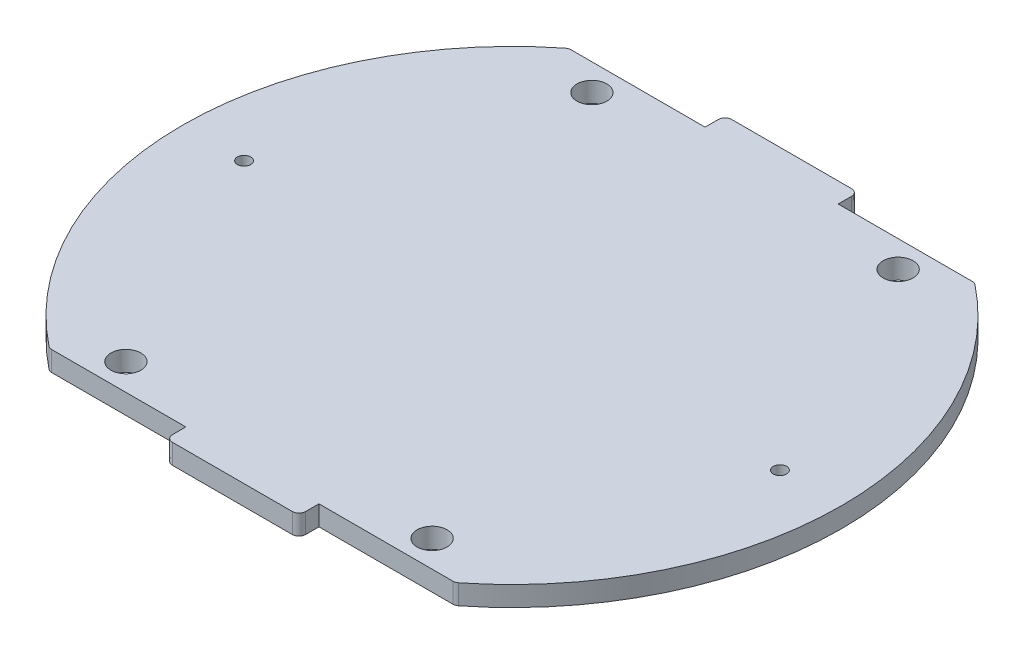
ISO-10303-21;
HEADER;
FILE_DESCRIPTION(('STEP AP214'),'2;1');
FILE_NAME('part.step','',(''),(''),'','','');
FILE_SCHEMA(('AUTOMOTIVE_DESIGN { 1 0 10303 214 1 1 1 1 }'));
ENDSEC;
DATA;
#1=APPLICATION_CONTEXT('core data for automotive mechanical design processes');
#2=APPLICATION_PROTOCOL_DEFINITION('international standard','automotive_design',2000,#1);
#3=PRODUCT_CONTEXT('',#1,'mechanical');
#4=PRODUCT('Part','Part','',(#3));
#5=PRODUCT_RELATED_PRODUCT_CATEGORY('part','',(#4));
#6=PRODUCT_DEFINITION_FORMATION('','',#4);
#7=PRODUCT_DEFINITION_CONTEXT('part definition',#1,'design');
#8=PRODUCT_DEFINITION('design','',#6,#7);
#9=PRODUCT_DEFINITION_SHAPE('','',#8);
#10=(LENGTH_UNIT() NAMED_UNIT(*) SI_UNIT(.MILLI.,.METRE.));
#11=(NAMED_UNIT(*) PLANE_ANGLE_UNIT() SI_UNIT($,.RADIAN.));
#12=(NAMED_UNIT(*) SI_UNIT($,.STERADIAN.) SOLID_ANGLE_UNIT());
#13=UNCERTAINTY_MEASURE_WITH_UNIT(LENGTH_MEASURE(1.E-05),#10,'distance_accuracy_value','');
#14=(GEOMETRIC_REPRESENTATION_CONTEXT(3) GLOBAL_UNCERTAINTY_ASSIGNED_CONTEXT((#13)) GLOBAL_UNIT_ASSIGNED_CONTEXT((#10,
#11,#12)) REPRESENTATION_CONTEXT('',''));
#15=CARTESIAN_POINT('',(0.,0.,0.));
#16=DIRECTION('',(0.,0.,1.));
#17=DIRECTION('',(1.,0.,0.));
#18=AXIS2_PLACEMENT_3D('',#15,#16,#17);
#19=CARTESIAN_POINT('',(0.,0.,0.));
#20=DIRECTION('',(0.,1.,0.));
#21=DIRECTION('',(0.,0.,1.));
#22=AXIS2_PLACEMENT_3D('',#19,#20,#21);
#23=PLANE('',#22);
#24=DIRECTION('',(0.,0.,-1.));
#25=VECTOR('',#24,1.);
#26=CARTESIAN_POINT('',(-7.5,0.,28.5));
#27=LINE('',#26,#25);
#28=CARTESIAN_POINT('',(-7.5,0.,31.5));
#29=VERTEX_POINT('',#28);
#30=CARTESIAN_POINT('',(-7.5,0.,25.5));
#31=VERTEX_POINT('',#30);
#32=EDGE_CURVE('E251',#29,#31,#27,.T.);
#33=ORIENTED_EDGE('',*,*,#32,.F.);
#34=DIRECTION('',(1.,0.,0.));
#35=VECTOR('',#34,1.);
#36=CARTESIAN_POINT('',(7.5,0.,31.5));
#37=LINE('',#36,#35);
#38=CARTESIAN_POINT('',(7.49999999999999,0.,31.5));
#39=VERTEX_POINT('',#38);
#40=EDGE_CURVE('E427',#29,#39,#37,.T.);
#41=ORIENTED_EDGE('',*,*,#40,.T.);
#42=DIRECTION('',(0.,0.,1.));
#43=VECTOR('',#42,1.);
#44=CARTESIAN_POINT('',(7.5,0.,28.5));
#45=LINE('',#44,#43);
#46=CARTESIAN_POINT('',(7.50000000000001,0.,25.5));
#47=VERTEX_POINT('',#46);
#48=EDGE_CURVE('E256',#47,#39,#45,.T.);
#49=ORIENTED_EDGE('',*,*,#48,.F.);
#50=DIRECTION('',(1.,0.,0.));
#51=VECTOR('',#50,1.);
#52=CARTESIAN_POINT('',(-7.5,0.,25.5));
#53=LINE('',#52,#51);
#54=EDGE_CURVE('E267',#31,#47,#53,.T.);
#55=ORIENTED_EDGE('',*,*,#54,.F.);
#56=EDGE_LOOP('',(#33,#41,#49,#55));
#57=FACE_BOUND('',#56,.T.);
#58=CARTESIAN_POINT('',(-40.25,0.,0.));
#59=DIRECTION('',(0.,1.,0.));
#60=DIRECTION('',(0.,0.,1.));
#61=AXIS2_PLACEMENT_3D('',#58,#59,#60);
#62=CIRCLE('',#61,0.999999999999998);
#63=CARTESIAN_POINT('',(-40.25,0.,1.));
#64=VERTEX_POINT('',#63);
#65=EDGE_CURVE('E820',#64,#64,#62,.T.);
#66=ORIENTED_EDGE('',*,*,#65,.T.);
#67=EDGE_LOOP('',(#66));
#68=FACE_BOUND('',#67,.T.);
#69=CARTESIAN_POINT('',(40.25,0.,0.));
#70=DIRECTION('',(0.,1.,0.));
#71=DIRECTION('',(0.,0.,-1.));
#72=AXIS2_PLACEMENT_3D('',#69,#70,#71);
#73=CIRCLE('',#72,0.999999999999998);
#74=CARTESIAN_POINT('',(40.25,0.,-0.999999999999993));
#75=VERTEX_POINT('',#74);
#76=EDGE_CURVE('E825',#75,#75,#73,.T.);
#77=ORIENTED_EDGE('',*,*,#76,.T.);
#78=EDGE_LOOP('',(#77));
#79=FACE_BOUND('',#78,.T.);
#80=CARTESIAN_POINT('',(-23.,0.,35.));
#81=DIRECTION('',(0.,1.,0.));
#82=DIRECTION('',(0.,0.,1.));
#83=AXIS2_PLACEMENT_3D('',#80,#81,#82);
#84=CIRCLE('',#83,2.2479);
#85=CARTESIAN_POINT('',(-23.,0.,37.2479));
#86=VERTEX_POINT('',#85);
#87=EDGE_CURVE('E829',#86,#86,#84,.T.);
#88=ORIENTED_EDGE('',*,*,#87,.T.);
#89=EDGE_LOOP('',(#88));
#90=FACE_BOUND('',#89,.T.);
#91=CARTESIAN_POINT('',(23.,0.,35.));
#92=DIRECTION('',(0.,1.,0.));
#93=DIRECTION('',(0.,0.,1.));
#94=AXIS2_PLACEMENT_3D('',#91,#92,#93);
#95=CIRCLE('',#94,2.2479);
#96=CARTESIAN_POINT('',(23.,0.,37.2479));
#97=VERTEX_POINT('',#96);
#98=EDGE_CURVE('E833',#97,#97,#95,.T.);
#99=ORIENTED_EDGE('',*,*,#98,.T.);
#100=EDGE_LOOP('',(#99));
#101=FACE_BOUND('',#100,.T.);
#102=CARTESIAN_POINT('',(23.,0.,-35.));
#103=DIRECTION('',(0.,1.,0.));
#104=DIRECTION('',(0.,0.,1.));
#105=AXIS2_PLACEMENT_3D('',#102,#103,#104);
#106=CIRCLE('',#105,2.2479);
#107=CARTESIAN_POINT('',(23.,0.,-32.7521));
#108=VERTEX_POINT('',#107);
#109=EDGE_CURVE('E837',#108,#108,#106,.T.);
#110=ORIENTED_EDGE('',*,*,#109,.T.);
#111=EDGE_LOOP('',(#110));
#112=FACE_BOUND('',#111,.T.);
#113=CARTESIAN_POINT('',(-23.,0.,-35.));
#114=DIRECTION('',(0.,1.,0.));
#115=DIRECTION('',(0.,0.,1.));
#116=AXIS2_PLACEMENT_3D('',#113,#114,#115);
#117=CIRCLE('',#116,2.2479);
#118=CARTESIAN_POINT('',(-23.,0.,-32.7521));
#119=VERTEX_POINT('',#118);
#120=EDGE_CURVE('E841',#119,#119,#117,.T.);
#121=ORIENTED_EDGE('',*,*,#120,.T.);
#122=EDGE_LOOP('',(#121));
#123=FACE_BOUND('',#122,.T.);
#124=DIRECTION('',(1.,0.,0.));
#125=VECTOR('',#124,1.);
#126=CARTESIAN_POINT('',(-30.4836021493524,0.,-39.));
#127=LINE('',#126,#125);
#128=CARTESIAN_POINT('',(10.,0.,-39.));
#129=VERTEX_POINT('',#128);
#130=CARTESIAN_POINT('',(30.1371863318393,0.,-39.));
#131=VERTEX_POINT('',#130);
#132=EDGE_CURVE('E327',#129,#131,#127,.T.);
#133=ORIENTED_EDGE('',*,*,#132,.T.);
#134=CARTESIAN_POINT('',(30.1371863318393,0.,-38.));
#135=DIRECTION('',(0.,1.,0.));
#136=DIRECTION('',(0.,0.,1.));
#137=AXIS2_PLACEMENT_3D('',#134,#135,#136);
#138=CIRCLE('',#137,1.);
#139=CARTESIAN_POINT('',(30.7585716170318,0.,-38.7835051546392));
#140=VERTEX_POINT('',#139);
#141=EDGE_CURVE('E365',#131,#140,#138,.F.);
#142=ORIENTED_EDGE('',*,*,#141,.T.);
#143=CARTESIAN_POINT('',(0.,0.,0.));
#144=DIRECTION('',(0.,-1.,0.));
#145=DIRECTION('',(0.,0.,-1.));
#146=AXIS2_PLACEMENT_3D('',#143,#144,#145);
#147=CIRCLE('',#146,49.5);
#148=CARTESIAN_POINT('',(30.7585716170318,0.,38.7835051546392));
#149=VERTEX_POINT('',#148);
#150=EDGE_CURVE('E320',#140,#149,#147,.T.);
#151=ORIENTED_EDGE('',*,*,#150,.T.);
#152=CARTESIAN_POINT('',(30.1371863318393,0.,38.));
#153=DIRECTION('',(0.,1.,0.));
#154=DIRECTION('',(0.,0.,1.));
#155=AXIS2_PLACEMENT_3D('',#152,#153,#154);
#156=CIRCLE('',#155,1.);
#157=CARTESIAN_POINT('',(30.1371863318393,0.,39.));
#158=VERTEX_POINT('',#157);
#159=EDGE_CURVE('E357',#149,#158,#156,.F.);
#160=ORIENTED_EDGE('',*,*,#159,.T.);
#161=DIRECTION('',(-1.,0.,0.));
#162=VECTOR('',#161,1.);
#163=CARTESIAN_POINT('',(30.4836021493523,0.,39.));
#164=LINE('',#163,#162);
#165=CARTESIAN_POINT('',(10.,0.,39.));
#166=VERTEX_POINT('',#165);
#167=EDGE_CURVE('E847',#158,#166,#164,.T.);
#168=ORIENTED_EDGE('',*,*,#167,.T.);
#169=DIRECTION('',(0.,0.,1.));
#170=VECTOR('',#169,1.);
#171=CARTESIAN_POINT('',(10.,0.,39.));
#172=LINE('',#171,#170);
#173=CARTESIAN_POINT('',(10.,0.,41.));
#174=VERTEX_POINT('',#173);
#175=EDGE_CURVE('E855',#166,#174,#172,.T.);
#176=ORIENTED_EDGE('',*,*,#175,.T.);
#177=CARTESIAN_POINT('',(9.,0.,41.));
#178=DIRECTION('',(0.,1.,0.));
#179=DIRECTION('',(0.,0.,1.));
#180=AXIS2_PLACEMENT_3D('',#177,#178,#179);
#181=CIRCLE('',#180,1.);
#182=CARTESIAN_POINT('',(9.,0.,42.));
#183=VERTEX_POINT('',#182);
#184=EDGE_CURVE('E352',#174,#183,#181,.F.);
#185=ORIENTED_EDGE('',*,*,#184,.T.);
#186=DIRECTION('',(-1.,0.,0.));
#187=VECTOR('',#186,1.);
#188=CARTESIAN_POINT('',(-10.,0.,42.));
#189=LINE('',#188,#187);
#190=CARTESIAN_POINT('',(-9.,0.,42.));
#191=VERTEX_POINT('',#190);
#192=EDGE_CURVE('E895',#183,#191,#189,.T.);
#193=ORIENTED_EDGE('',*,*,#192,.T.);
#194=CARTESIAN_POINT('',(-9.,0.,41.));
#195=DIRECTION('',(0.,1.,0.));
#196=DIRECTION('',(0.,0.,1.));
#197=AXIS2_PLACEMENT_3D('',#194,#195,#196);
#198=CIRCLE('',#197,1.);
#199=CARTESIAN_POINT('',(-10.,0.,41.));
#200=VERTEX_POINT('',#199);
#201=EDGE_CURVE('E350',#191,#200,#198,.F.);
#202=ORIENTED_EDGE('',*,*,#201,.T.);
#203=DIRECTION('',(0.,0.,-1.));
#204=VECTOR('',#203,1.);
#205=CARTESIAN_POINT('',(-10.,0.,39.));
#206=LINE('',#205,#204);
#207=CARTESIAN_POINT('',(-10.,0.,39.));
#208=VERTEX_POINT('',#207);
#209=EDGE_CURVE('E335',#200,#208,#206,.T.);
#210=ORIENTED_EDGE('',*,*,#209,.T.);
#211=CARTESIAN_POINT('',(-30.1371863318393,0.,39.));
#212=VERTEX_POINT('',#211);
#213=EDGE_CURVE('E844',#208,#212,#164,.T.);
#214=ORIENTED_EDGE('',*,*,#213,.T.);
#215=CARTESIAN_POINT('',(-30.1371863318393,0.,38.));
#216=DIRECTION('',(0.,1.,0.));
#217=DIRECTION('',(0.,0.,1.));
#218=AXIS2_PLACEMENT_3D('',#215,#216,#217);
#219=CIRCLE('',#218,1.);
#220=CARTESIAN_POINT('',(-30.7585716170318,0.,38.7835051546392));
#221=VERTEX_POINT('',#220);
#222=EDGE_CURVE('E355',#212,#221,#219,.F.);
#223=ORIENTED_EDGE('',*,*,#222,.T.);
#224=CARTESIAN_POINT('',(0.,0.,0.));
#225=DIRECTION('',(0.,-1.,0.));
#226=DIRECTION('',(0.,0.,-1.));
#227=AXIS2_PLACEMENT_3D('',#224,#225,#226);
#228=CIRCLE('',#227,49.5);
#229=CARTESIAN_POINT('',(-30.7585716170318,0.,-38.7835051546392));
#230=VERTEX_POINT('',#229);
#231=EDGE_CURVE('E852',#221,#230,#228,.T.);
#232=ORIENTED_EDGE('',*,*,#231,.T.);
#233=CARTESIAN_POINT('',(-30.1371863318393,0.,-38.));
#234=DIRECTION('',(0.,1.,0.));
#235=DIRECTION('',(0.,0.,1.));
#236=AXIS2_PLACEMENT_3D('',#233,#234,#235);
#237=CIRCLE('',#236,1.);
#238=CARTESIAN_POINT('',(-30.1371863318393,0.,-39.));
#239=VERTEX_POINT('',#238);
#240=EDGE_CURVE('E363',#230,#239,#237,.F.);
#241=ORIENTED_EDGE('',*,*,#240,.T.);
#242=CARTESIAN_POINT('',(-10.,0.,-39.));
#243=VERTEX_POINT('',#242);
#244=EDGE_CURVE('E348',#239,#243,#127,.T.);
#245=ORIENTED_EDGE('',*,*,#244,.T.);
#246=DIRECTION('',(0.,0.,-1.));
#247=VECTOR('',#246,1.);
#248=CARTESIAN_POINT('',(-10.,0.,-39.));
#249=LINE('',#248,#247);
#250=CARTESIAN_POINT('',(-10.,0.,-41.));
#251=VERTEX_POINT('',#250);
#252=EDGE_CURVE('E276',#243,#251,#249,.T.);
#253=ORIENTED_EDGE('',*,*,#252,.T.);
#254=CARTESIAN_POINT('',(-9.,0.,-41.));
#255=DIRECTION('',(0.,1.,0.));
#256=DIRECTION('',(0.,0.,1.));
#257=AXIS2_PLACEMENT_3D('',#254,#255,#256);
#258=CIRCLE('',#257,1.);
#259=CARTESIAN_POINT('',(-9.,0.,-42.));
#260=VERTEX_POINT('',#259);
#261=EDGE_CURVE('E359',#251,#260,#258,.F.);
#262=ORIENTED_EDGE('',*,*,#261,.T.);
#263=DIRECTION('',(1.,0.,0.));
#264=VECTOR('',#263,1.);
#265=CARTESIAN_POINT('',(-10.,0.,-42.));
#266=LINE('',#265,#264);
#267=CARTESIAN_POINT('',(9.,0.,-42.));
#268=VERTEX_POINT('',#267);
#269=EDGE_CURVE('E277',#260,#268,#266,.T.);
#270=ORIENTED_EDGE('',*,*,#269,.T.);
#271=CARTESIAN_POINT('',(9.,0.,-41.));
#272=DIRECTION('',(0.,1.,0.));
#273=DIRECTION('',(0.,0.,1.));
#274=AXIS2_PLACEMENT_3D('',#271,#272,#273);
#275=CIRCLE('',#274,1.);
#276=CARTESIAN_POINT('',(10.,0.,-41.));
#277=VERTEX_POINT('',#276);
#278=EDGE_CURVE('E361',#268,#277,#275,.F.);
#279=ORIENTED_EDGE('',*,*,#278,.T.);
#280=DIRECTION('',(0.,0.,1.));
#281=VECTOR('',#280,1.);
#282=CARTESIAN_POINT('',(10.,0.,-39.));
#283=LINE('',#282,#281);
#284=EDGE_CURVE('E280',#277,#129,#283,.T.);
#285=ORIENTED_EDGE('',*,*,#284,.T.);
#286=EDGE_LOOP('',(#133,#142,#151,#160,#168,#176,#185,#193,#202,#210,#214,#223,#232,#241,#245,
#253,#262,#270,#279,#285));
#287=FACE_BOUND('',#286,.T.);
#288=DIRECTION('',(0.,0.,1.));
#289=VECTOR('',#288,1.);
#290=CARTESIAN_POINT('',(7.5,0.,-28.5));
#291=LINE('',#290,#289);
#292=CARTESIAN_POINT('',(7.49999999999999,0.,-31.5));
#293=VERTEX_POINT('',#292);
#294=CARTESIAN_POINT('',(7.50000000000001,0.,-25.5));
#295=VERTEX_POINT('',#294);
#296=EDGE_CURVE('E47',#293,#295,#291,.T.);
#297=ORIENTED_EDGE('',*,*,#296,.F.);
#298=DIRECTION('',(-1.,0.,0.));
#299=VECTOR('',#298,1.);
#300=CARTESIAN_POINT('',(-7.5,0.,-31.5));
#301=LINE('',#300,#299);
#302=CARTESIAN_POINT('',(-7.5,0.,-31.5));
#303=VERTEX_POINT('',#302);
#304=EDGE_CURVE('E222',#293,#303,#301,.T.);
#305=ORIENTED_EDGE('',*,*,#304,.T.);
#306=DIRECTION('',(0.,0.,-1.));
#307=VECTOR('',#306,1.);
#308=CARTESIAN_POINT('',(-7.5,0.,-28.5));
#309=LINE('',#308,#307);
#310=CARTESIAN_POINT('',(-7.5,0.,-25.5));
#311=VERTEX_POINT('',#310);
#312=EDGE_CURVE('E55',#311,#303,#309,.T.);
#313=ORIENTED_EDGE('',*,*,#312,.F.);
#314=DIRECTION('',(-1.,0.,0.));
#315=VECTOR('',#314,1.);
#316=CARTESIAN_POINT('',(-7.5,0.,-25.5));
#317=LINE('',#316,#315);
#318=EDGE_CURVE('E240',#295,#311,#317,.T.);
#319=ORIENTED_EDGE('',*,*,#318,.F.);
#320=EDGE_LOOP('',(#297,#305,#313,#319));
#321=FACE_BOUND('',#320,.T.);
#322=ADVANCED_FACE('F32',(#57,#68,#79,#90,#101,#112,#123,#287,#321),#23,.F.);
#323=CARTESIAN_POINT('',(-30.4836021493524,3.,-39.));
#324=DIRECTION('',(0.,0.,-1.));
#325=DIRECTION('',(-1.,0.,0.));
#326=AXIS2_PLACEMENT_3D('',#323,#324,#325);
#327=PLANE('',#326);
#328=ORIENTED_EDGE('',*,*,#244,.F.);
#329=DIRECTION('',(0.,-1.,0.));
#330=VECTOR('',#329,1.);
#331=CARTESIAN_POINT('',(-30.1371863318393,3.,-39.));
#332=LINE('',#331,#330);
#333=CARTESIAN_POINT('',(-30.1371863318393,3.,-39.));
#334=VERTEX_POINT('',#333);
#335=EDGE_CURVE('E401',#239,#334,#332,.F.);
#336=ORIENTED_EDGE('',*,*,#335,.T.);
#337=DIRECTION('',(1.,0.,0.));
#338=VECTOR('',#337,1.);
#339=CARTESIAN_POINT('',(-30.4836021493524,3.,-39.));
#340=LINE('',#339,#338);
#341=CARTESIAN_POINT('',(-10.,3.,-39.));
#342=VERTEX_POINT('',#341);
#343=EDGE_CURVE('E308',#334,#342,#340,.T.);
#344=ORIENTED_EDGE('',*,*,#343,.T.);
#345=DIRECTION('',(0.,-1.,0.));
#346=VECTOR('',#345,1.);
#347=CARTESIAN_POINT('',(-10.,23.2237484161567,-39.));
#348=LINE('',#347,#346);
#349=EDGE_CURVE('E295',#342,#243,#348,.T.);
#350=ORIENTED_EDGE('',*,*,#349,.T.);
#351=EDGE_LOOP('',(#328,#336,#344,#350));
#352=FACE_BOUND('',#351,.T.);
#353=ADVANCED_FACE('F459',(#352),#327,.T.);
#354=CARTESIAN_POINT('',(30.4836021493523,3.,39.));
#355=DIRECTION('',(0.,0.,1.));
#356=DIRECTION('',(1.,0.,0.));
#357=AXIS2_PLACEMENT_3D('',#354,#355,#356);
#358=PLANE('',#357);
#359=ORIENTED_EDGE('',*,*,#167,.F.);
#360=DIRECTION('',(0.,-1.,0.));
#361=VECTOR('',#360,1.);
#362=CARTESIAN_POINT('',(30.1371863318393,3.,39.));
#363=LINE('',#362,#361);
#364=CARTESIAN_POINT('',(30.1371863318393,3.,39.));
#365=VERTEX_POINT('',#364);
#366=EDGE_CURVE('E412',#158,#365,#363,.F.);
#367=ORIENTED_EDGE('',*,*,#366,.T.);
#368=DIRECTION('',(-1.,0.,0.));
#369=VECTOR('',#368,1.);
#370=CARTESIAN_POINT('',(30.4836021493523,3.,39.));
#371=LINE('',#370,#369);
#372=CARTESIAN_POINT('',(10.,3.,39.));
#373=VERTEX_POINT('',#372);
#374=EDGE_CURVE('E305',#365,#373,#371,.T.);
#375=ORIENTED_EDGE('',*,*,#374,.T.);
#376=DIRECTION('',(0.,-1.,0.));
#377=VECTOR('',#376,1.);
#378=CARTESIAN_POINT('',(10.,23.2237484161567,39.));
#379=LINE('',#378,#377);
#380=EDGE_CURVE('E893',#373,#166,#379,.T.);
#381=ORIENTED_EDGE('',*,*,#380,.T.);
#382=EDGE_LOOP('',(#359,#367,#375,#381));
#383=FACE_BOUND('',#382,.T.);
#384=ADVANCED_FACE('F464',(#383),#358,.T.);
#385=CARTESIAN_POINT('',(0.,3.,0.));
#386=DIRECTION('',(0.,1.,0.));
#387=DIRECTION('',(0.,0.,1.));
#388=AXIS2_PLACEMENT_3D('',#385,#386,#387);
#389=PLANE('',#388);
#390=CARTESIAN_POINT('',(-40.25,3.,0.));
#391=DIRECTION('',(0.,1.,0.));
#392=DIRECTION('',(0.,0.,1.));
#393=AXIS2_PLACEMENT_3D('',#390,#391,#392);
#394=CIRCLE('',#393,0.999999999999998);
#395=CARTESIAN_POINT('',(-40.25,3.,1.));
#396=VERTEX_POINT('',#395);
#397=EDGE_CURVE('E817',#396,#396,#394,.T.);
#398=ORIENTED_EDGE('',*,*,#397,.F.);
#399=EDGE_LOOP('',(#398));
#400=FACE_BOUND('',#399,.T.);
#401=CARTESIAN_POINT('',(40.25,3.,0.));
#402=DIRECTION('',(0.,1.,0.));
#403=DIRECTION('',(0.,0.,-1.));
#404=AXIS2_PLACEMENT_3D('',#401,#402,#403);
#405=CIRCLE('',#404,0.999999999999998);
#406=CARTESIAN_POINT('',(40.25,3.,-0.999999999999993));
#407=VERTEX_POINT('',#406);
#408=EDGE_CURVE('E821',#407,#407,#405,.T.);
#409=ORIENTED_EDGE('',*,*,#408,.F.);
#410=EDGE_LOOP('',(#409));
#411=FACE_BOUND('',#410,.T.);
#412=CARTESIAN_POINT('',(-23.,3.,35.));
#413=DIRECTION('',(0.,1.,0.));
#414=DIRECTION('',(0.,0.,1.));
#415=AXIS2_PLACEMENT_3D('',#412,#413,#414);
#416=CIRCLE('',#415,2.2479);
#417=CARTESIAN_POINT('',(-23.,3.,37.2479));
#418=VERTEX_POINT('',#417);
#419=EDGE_CURVE('E832',#418,#418,#416,.T.);
#420=ORIENTED_EDGE('',*,*,#419,.F.);
#421=EDGE_LOOP('',(#420));
#422=FACE_BOUND('',#421,.T.);
#423=CARTESIAN_POINT('',(23.,3.,35.));
#424=DIRECTION('',(0.,1.,0.));
#425=DIRECTION('',(0.,0.,1.));
#426=AXIS2_PLACEMENT_3D('',#423,#424,#425);
#427=CIRCLE('',#426,2.2479);
#428=CARTESIAN_POINT('',(23.,3.,37.2479));
#429=VERTEX_POINT('',#428);
#430=EDGE_CURVE('E836',#429,#429,#427,.T.);
#431=ORIENTED_EDGE('',*,*,#430,.F.);
#432=EDGE_LOOP('',(#431));
#433=FACE_BOUND('',#432,.T.);
#434=CARTESIAN_POINT('',(23.,3.,-35.));
#435=DIRECTION('',(0.,1.,0.));
#436=DIRECTION('',(0.,0.,1.));
#437=AXIS2_PLACEMENT_3D('',#434,#435,#436);
#438=CIRCLE('',#437,2.2479);
#439=CARTESIAN_POINT('',(23.,3.,-32.7521));
#440=VERTEX_POINT('',#439);
#441=EDGE_CURVE('E840',#440,#440,#438,.T.);
#442=ORIENTED_EDGE('',*,*,#441,.F.);
#443=EDGE_LOOP('',(#442));
#444=FACE_BOUND('',#443,.T.);
#445=CARTESIAN_POINT('',(-23.,3.,-35.));
#446=DIRECTION('',(0.,1.,0.));
#447=DIRECTION('',(0.,0.,1.));
#448=AXIS2_PLACEMENT_3D('',#445,#446,#447);
#449=CIRCLE('',#448,2.2479);
#450=CARTESIAN_POINT('',(-23.,3.,-32.7521));
#451=VERTEX_POINT('',#450);
#452=EDGE_CURVE('E311',#451,#451,#449,.T.);
#453=ORIENTED_EDGE('',*,*,#452,.F.);
#454=EDGE_LOOP('',(#453));
#455=FACE_BOUND('',#454,.T.);
#456=CARTESIAN_POINT('',(0.,3.,0.));
#457=DIRECTION('',(0.,-1.,0.));
#458=DIRECTION('',(0.,0.,-1.));
#459=AXIS2_PLACEMENT_3D('',#456,#457,#458);
#460=CIRCLE('',#459,49.5);
#461=CARTESIAN_POINT('',(30.7585716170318,3.,-38.7835051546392));
#462=VERTEX_POINT('',#461);
#463=CARTESIAN_POINT('',(30.7585716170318,3.,38.7835051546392));
#464=VERTEX_POINT('',#463);
#465=EDGE_CURVE('E868',#462,#464,#460,.T.);
#466=ORIENTED_EDGE('',*,*,#465,.F.);
#467=CARTESIAN_POINT('',(30.1371863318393,3.,-38.));
#468=DIRECTION('',(0.,1.,0.));
#469=DIRECTION('',(0.,0.,1.));
#470=AXIS2_PLACEMENT_3D('',#467,#468,#469);
#471=CIRCLE('',#470,1.);
#472=CARTESIAN_POINT('',(30.1371863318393,3.,-39.));
#473=VERTEX_POINT('',#472);
#474=EDGE_CURVE('E394',#462,#473,#471,.T.);
#475=ORIENTED_EDGE('',*,*,#474,.T.);
#476=CARTESIAN_POINT('',(10.,3.,-39.));
#477=VERTEX_POINT('',#476);
#478=EDGE_CURVE('E312',#477,#473,#340,.T.);
#479=ORIENTED_EDGE('',*,*,#478,.F.);
#480=DIRECTION('',(0.,0.,1.));
#481=VECTOR('',#480,1.);
#482=CARTESIAN_POINT('',(10.,3.,-39.));
#483=LINE('',#482,#481);
#484=CARTESIAN_POINT('',(10.,3.,-41.));
#485=VERTEX_POINT('',#484);
#486=EDGE_CURVE('E284',#485,#477,#483,.T.);
#487=ORIENTED_EDGE('',*,*,#486,.F.);
#488=CARTESIAN_POINT('',(9.,3.,-41.));
#489=DIRECTION('',(0.,1.,0.));
#490=DIRECTION('',(0.,0.,1.));
#491=AXIS2_PLACEMENT_3D('',#488,#489,#490);
#492=CIRCLE('',#491,1.);
#493=CARTESIAN_POINT('',(9.,3.,-42.));
#494=VERTEX_POINT('',#493);
#495=EDGE_CURVE('E390',#485,#494,#492,.T.);
#496=ORIENTED_EDGE('',*,*,#495,.T.);
#497=DIRECTION('',(1.,0.,0.));
#498=VECTOR('',#497,1.);
#499=CARTESIAN_POINT('',(-10.,3.,-42.));
#500=LINE('',#499,#498);
#501=CARTESIAN_POINT('',(-9.,3.,-42.));
#502=VERTEX_POINT('',#501);
#503=EDGE_CURVE('E281',#502,#494,#500,.T.);
#504=ORIENTED_EDGE('',*,*,#503,.F.);
#505=CARTESIAN_POINT('',(-9.,3.,-41.));
#506=DIRECTION('',(0.,1.,0.));
#507=DIRECTION('',(0.,0.,1.));
#508=AXIS2_PLACEMENT_3D('',#505,#506,#507);
#509=CIRCLE('',#508,1.);
#510=CARTESIAN_POINT('',(-10.,3.,-41.));
#511=VERTEX_POINT('',#510);
#512=EDGE_CURVE('E388',#502,#511,#509,.T.);
#513=ORIENTED_EDGE('',*,*,#512,.T.);
#514=DIRECTION('',(0.,0.,-1.));
#515=VECTOR('',#514,1.);
#516=CARTESIAN_POINT('',(-10.,3.,-39.));
#517=LINE('',#516,#515);
#518=EDGE_CURVE('E285',#342,#511,#517,.T.);
#519=ORIENTED_EDGE('',*,*,#518,.F.);
#520=ORIENTED_EDGE('',*,*,#343,.F.);
#521=CARTESIAN_POINT('',(-30.1371863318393,3.,-38.));
#522=DIRECTION('',(0.,1.,0.));
#523=DIRECTION('',(0.,0.,1.));
#524=AXIS2_PLACEMENT_3D('',#521,#522,#523);
#525=CIRCLE('',#524,1.);
#526=CARTESIAN_POINT('',(-30.7585716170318,3.,-38.7835051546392));
#527=VERTEX_POINT('',#526);
#528=EDGE_CURVE('E392',#334,#527,#525,.T.);
#529=ORIENTED_EDGE('',*,*,#528,.T.);
#530=CARTESIAN_POINT('',(0.,3.,0.));
#531=DIRECTION('',(0.,-1.,0.));
#532=DIRECTION('',(0.,0.,-1.));
#533=AXIS2_PLACEMENT_3D('',#530,#531,#532);
#534=CIRCLE('',#533,49.5);
#535=CARTESIAN_POINT('',(-30.7585716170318,3.,38.7835051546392));
#536=VERTEX_POINT('',#535);
#537=EDGE_CURVE('E319',#536,#527,#534,.T.);
#538=ORIENTED_EDGE('',*,*,#537,.F.);
#539=CARTESIAN_POINT('',(-30.1371863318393,3.,38.));
#540=DIRECTION('',(0.,1.,0.));
#541=DIRECTION('',(0.,0.,1.));
#542=AXIS2_PLACEMENT_3D('',#539,#540,#541);
#543=CIRCLE('',#542,1.);
#544=CARTESIAN_POINT('',(-30.1371863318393,3.,39.));
#545=VERTEX_POINT('',#544);
#546=EDGE_CURVE('E382',#536,#545,#543,.T.);
#547=ORIENTED_EDGE('',*,*,#546,.T.);
#548=CARTESIAN_POINT('',(-10.,3.,39.));
#549=VERTEX_POINT('',#548);
#550=EDGE_CURVE('E848',#549,#545,#371,.T.);
#551=ORIENTED_EDGE('',*,*,#550,.F.);
#552=DIRECTION('',(0.,0.,-1.));
#553=VECTOR('',#552,1.);
#554=CARTESIAN_POINT('',(-10.,3.,39.));
#555=LINE('',#554,#553);
#556=CARTESIAN_POINT('',(-10.,3.,41.));
#557=VERTEX_POINT('',#556);
#558=EDGE_CURVE('E313',#557,#549,#555,.T.);
#559=ORIENTED_EDGE('',*,*,#558,.F.);
#560=CARTESIAN_POINT('',(-9.,3.,41.));
#561=DIRECTION('',(0.,1.,0.));
#562=DIRECTION('',(0.,0.,1.));
#563=AXIS2_PLACEMENT_3D('',#560,#561,#562);
#564=CIRCLE('',#563,1.);
#565=CARTESIAN_POINT('',(-9.,3.,42.));
#566=VERTEX_POINT('',#565);
#567=EDGE_CURVE('E370',#557,#566,#564,.T.);
#568=ORIENTED_EDGE('',*,*,#567,.T.);
#569=DIRECTION('',(-1.,0.,0.));
#570=VECTOR('',#569,1.);
#571=CARTESIAN_POINT('',(-10.,3.,42.));
#572=LINE('',#571,#570);
#573=CARTESIAN_POINT('',(9.,3.,42.));
#574=VERTEX_POINT('',#573);
#575=EDGE_CURVE('E889',#574,#566,#572,.T.);
#576=ORIENTED_EDGE('',*,*,#575,.F.);
#577=CARTESIAN_POINT('',(9.,3.,41.));
#578=DIRECTION('',(0.,1.,0.));
#579=DIRECTION('',(0.,0.,1.));
#580=AXIS2_PLACEMENT_3D('',#577,#578,#579);
#581=CIRCLE('',#580,1.);
#582=CARTESIAN_POINT('',(10.,3.,41.));
#583=VERTEX_POINT('',#582);
#584=EDGE_CURVE('E376',#574,#583,#581,.T.);
#585=ORIENTED_EDGE('',*,*,#584,.T.);
#586=DIRECTION('',(0.,0.,1.));
#587=VECTOR('',#586,1.);
#588=CARTESIAN_POINT('',(10.,3.,39.));
#589=LINE('',#588,#587);
#590=EDGE_CURVE('E890',#373,#583,#589,.T.);
#591=ORIENTED_EDGE('',*,*,#590,.F.);
#592=ORIENTED_EDGE('',*,*,#374,.F.);
#593=CARTESIAN_POINT('',(30.1371863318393,3.,38.));
#594=DIRECTION('',(0.,1.,0.));
#595=DIRECTION('',(0.,0.,1.));
#596=AXIS2_PLACEMENT_3D('',#593,#594,#595);
#597=CIRCLE('',#596,1.);
#598=EDGE_CURVE('E386',#365,#464,#597,.T.);
#599=ORIENTED_EDGE('',*,*,#598,.T.);
#600=EDGE_LOOP('',(#466,#475,#479,#487,#496,#504,#513,#519,#520,#529,#538,#547,#551,#559,#568,
#576,#585,#591,#592,#599));
#601=FACE_BOUND('',#600,.T.);
#602=ADVANCED_FACE('F470',(#400,#411,#422,#433,#444,#455,#601),#389,.T.);
#603=CARTESIAN_POINT('',(-40.25,3.,0.));
#604=DIRECTION('',(0.,-1.,0.));
#605=DIRECTION('',(0.,0.,-1.));
#606=AXIS2_PLACEMENT_3D('',#603,#604,#605);
#607=CYLINDRICAL_SURFACE('',#606,0.999999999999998);
#608=ORIENTED_EDGE('',*,*,#397,.T.);
#609=EDGE_LOOP('',(#608));
#610=FACE_BOUND('',#609,.T.);
#611=ORIENTED_EDGE('',*,*,#65,.F.);
#612=EDGE_LOOP('',(#611));
#613=FACE_BOUND('',#612,.T.);
#614=ADVANCED_FACE('F685',(#610,#613),#607,.F.);
#615=CARTESIAN_POINT('',(40.25,3.,0.));
#616=DIRECTION('',(0.,-1.,0.));
#617=DIRECTION('',(0.,0.,-1.));
#618=AXIS2_PLACEMENT_3D('',#615,#616,#617);
#619=CYLINDRICAL_SURFACE('',#618,0.999999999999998);
#620=ORIENTED_EDGE('',*,*,#408,.T.);
#621=EDGE_LOOP('',(#620));
#622=FACE_BOUND('',#621,.T.);
#623=ORIENTED_EDGE('',*,*,#76,.F.);
#624=EDGE_LOOP('',(#623));
#625=FACE_BOUND('',#624,.T.);
#626=ADVANCED_FACE('F790',(#622,#625),#619,.F.);
#627=CARTESIAN_POINT('',(-23.,3.,35.));
#628=DIRECTION('',(0.,1.,0.));
#629=DIRECTION('',(0.,0.,1.));
#630=AXIS2_PLACEMENT_3D('',#627,#628,#629);
#631=CYLINDRICAL_SURFACE('',#630,2.2479);
#632=ORIENTED_EDGE('',*,*,#419,.T.);
#633=EDGE_LOOP('',(#632));
#634=FACE_BOUND('',#633,.T.);
#635=ORIENTED_EDGE('',*,*,#87,.F.);
#636=EDGE_LOOP('',(#635));
#637=FACE_BOUND('',#636,.T.);
#638=ADVANCED_FACE('F781',(#634,#637),#631,.F.);
#639=CARTESIAN_POINT('',(23.,3.,35.));
#640=DIRECTION('',(0.,1.,0.));
#641=DIRECTION('',(0.,0.,1.));
#642=AXIS2_PLACEMENT_3D('',#639,#640,#641);
#643=CYLINDRICAL_SURFACE('',#642,2.2479);
#644=ORIENTED_EDGE('',*,*,#430,.T.);
#645=EDGE_LOOP('',(#644));
#646=FACE_BOUND('',#645,.T.);
#647=ORIENTED_EDGE('',*,*,#98,.F.);
#648=EDGE_LOOP('',(#647));
#649=FACE_BOUND('',#648,.T.);
#650=ADVANCED_FACE('F772',(#646,#649),#643,.F.);
#651=CARTESIAN_POINT('',(23.,3.,-35.));
#652=DIRECTION('',(0.,1.,0.));
#653=DIRECTION('',(0.,0.,1.));
#654=AXIS2_PLACEMENT_3D('',#651,#652,#653);
#655=CYLINDRICAL_SURFACE('',#654,2.2479);
#656=ORIENTED_EDGE('',*,*,#441,.T.);
#657=EDGE_LOOP('',(#656));
#658=FACE_BOUND('',#657,.T.);
#659=ORIENTED_EDGE('',*,*,#109,.F.);
#660=EDGE_LOOP('',(#659));
#661=FACE_BOUND('',#660,.T.);
#662=ADVANCED_FACE('F763',(#658,#661),#655,.F.);
#663=CARTESIAN_POINT('',(-23.,3.,-35.));
#664=DIRECTION('',(0.,1.,0.));
#665=DIRECTION('',(0.,0.,1.));
#666=AXIS2_PLACEMENT_3D('',#663,#664,#665);
#667=CYLINDRICAL_SURFACE('',#666,2.2479);
#668=ORIENTED_EDGE('',*,*,#452,.T.);
#669=EDGE_LOOP('',(#668));
#670=FACE_BOUND('',#669,.T.);
#671=ORIENTED_EDGE('',*,*,#120,.F.);
#672=EDGE_LOOP('',(#671));
#673=FACE_BOUND('',#672,.T.);
#674=ADVANCED_FACE('F705',(#670,#673),#667,.F.);
#675=CARTESIAN_POINT('',(0.,3.,0.));
#676=DIRECTION('',(0.,-1.,0.));
#677=DIRECTION('',(0.,0.,-1.));
#678=AXIS2_PLACEMENT_3D('',#675,#676,#677);
#679=CYLINDRICAL_SURFACE('',#678,49.5);
#680=ORIENTED_EDGE('',*,*,#150,.F.);
#681=DIRECTION('',(0.,-1.,0.));
#682=VECTOR('',#681,1.);
#683=CARTESIAN_POINT('',(30.7585716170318,3.,-38.7835051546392));
#684=LINE('',#683,#682);
#685=EDGE_CURVE('E369',#140,#462,#684,.F.);
#686=ORIENTED_EDGE('',*,*,#685,.T.);
#687=ORIENTED_EDGE('',*,*,#465,.T.);
#688=DIRECTION('',(0.,-1.,0.));
#689=VECTOR('',#688,1.);
#690=CARTESIAN_POINT('',(30.7585716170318,3.,38.7835051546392));
#691=LINE('',#690,#689);
#692=EDGE_CURVE('E367',#464,#149,#691,.T.);
#693=ORIENTED_EDGE('',*,*,#692,.T.);
#694=EDGE_LOOP('',(#680,#686,#687,#693));
#695=FACE_BOUND('',#694,.T.);
#696=ADVANCED_FACE('F700',(#695),#679,.T.);
#697=ORIENTED_EDGE('',*,*,#478,.T.);
#698=DIRECTION('',(0.,-1.,0.));
#699=VECTOR('',#698,1.);
#700=CARTESIAN_POINT('',(30.1371863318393,3.,-39.));
#701=LINE('',#700,#699);
#702=EDGE_CURVE('E353',#473,#131,#701,.T.);
#703=ORIENTED_EDGE('',*,*,#702,.T.);
#704=ORIENTED_EDGE('',*,*,#132,.F.);
#705=DIRECTION('',(0.,-1.,0.));
#706=VECTOR('',#705,1.);
#707=CARTESIAN_POINT('',(10.,23.2237484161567,-39.));
#708=LINE('',#707,#706);
#709=EDGE_CURVE('E291',#477,#129,#708,.T.);
#710=ORIENTED_EDGE('',*,*,#709,.F.);
#711=EDGE_LOOP('',(#697,#703,#704,#710));
#712=FACE_BOUND('',#711,.T.);
#713=ADVANCED_FACE('F467',(#712),#327,.T.);
#714=CARTESIAN_POINT('',(0.,3.,0.));
#715=DIRECTION('',(0.,-1.,0.));
#716=DIRECTION('',(0.,0.,-1.));
#717=AXIS2_PLACEMENT_3D('',#714,#715,#716);
#718=CYLINDRICAL_SURFACE('',#717,49.5);
#719=ORIENTED_EDGE('',*,*,#537,.T.);
#720=DIRECTION('',(0.,-1.,0.));
#721=VECTOR('',#720,1.);
#722=CARTESIAN_POINT('',(-30.7585716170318,3.,-38.7835051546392));
#723=LINE('',#722,#721);
#724=EDGE_CURVE('E398',#527,#230,#723,.T.);
#725=ORIENTED_EDGE('',*,*,#724,.T.);
#726=ORIENTED_EDGE('',*,*,#231,.F.);
#727=DIRECTION('',(0.,-1.,0.));
#728=VECTOR('',#727,1.);
#729=CARTESIAN_POINT('',(-30.7585716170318,3.,38.7835051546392));
#730=LINE('',#729,#728);
#731=EDGE_CURVE('E396',#221,#536,#730,.F.);
#732=ORIENTED_EDGE('',*,*,#731,.T.);
#733=EDGE_LOOP('',(#719,#725,#726,#732));
#734=FACE_BOUND('',#733,.T.);
#735=ADVANCED_FACE('F715',(#734),#718,.T.);
#736=ORIENTED_EDGE('',*,*,#550,.T.);
#737=DIRECTION('',(0.,-1.,0.));
#738=VECTOR('',#737,1.);
#739=CARTESIAN_POINT('',(-30.1371863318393,3.,39.));
#740=LINE('',#739,#738);
#741=EDGE_CURVE('E414',#545,#212,#740,.T.);
#742=ORIENTED_EDGE('',*,*,#741,.T.);
#743=ORIENTED_EDGE('',*,*,#213,.F.);
#744=DIRECTION('',(0.,-1.,0.));
#745=VECTOR('',#744,1.);
#746=CARTESIAN_POINT('',(-10.,23.2237484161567,39.));
#747=LINE('',#746,#745);
#748=EDGE_CURVE('E858',#549,#208,#747,.T.);
#749=ORIENTED_EDGE('',*,*,#748,.F.);
#750=EDGE_LOOP('',(#736,#742,#743,#749));
#751=FACE_BOUND('',#750,.T.);
#752=ADVANCED_FACE('F675',(#751),#358,.T.);
#753=CARTESIAN_POINT('',(10.,23.2237484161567,39.));
#754=DIRECTION('',(1.,0.,0.));
#755=DIRECTION('',(0.,0.,-1.));
#756=AXIS2_PLACEMENT_3D('',#753,#754,#755);
#757=PLANE('',#756);
#758=ORIENTED_EDGE('',*,*,#590,.T.);
#759=DIRECTION('',(0.,-1.,0.));
#760=VECTOR('',#759,1.);
#761=CARTESIAN_POINT('',(10.,23.2237484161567,41.));
#762=LINE('',#761,#760);
#763=EDGE_CURVE('E417',#583,#174,#762,.T.);
#764=ORIENTED_EDGE('',*,*,#763,.T.);
#765=ORIENTED_EDGE('',*,*,#175,.F.);
#766=ORIENTED_EDGE('',*,*,#380,.F.);
#767=EDGE_LOOP('',(#758,#764,#765,#766));
#768=FACE_BOUND('',#767,.T.);
#769=ADVANCED_FACE('F666',(#768),#757,.T.);
#770=CARTESIAN_POINT('',(-10.,23.2237484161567,42.));
#771=DIRECTION('',(0.,0.,1.));
#772=DIRECTION('',(1.,0.,0.));
#773=AXIS2_PLACEMENT_3D('',#770,#771,#772);
#774=PLANE('',#773);
#775=ORIENTED_EDGE('',*,*,#192,.F.);
#776=DIRECTION('',(0.,-1.,0.));
#777=VECTOR('',#776,1.);
#778=CARTESIAN_POINT('',(9.,23.2237484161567,42.));
#779=LINE('',#778,#777);
#780=EDGE_CURVE('E423',#183,#574,#779,.F.);
#781=ORIENTED_EDGE('',*,*,#780,.T.);
#782=ORIENTED_EDGE('',*,*,#575,.T.);
#783=DIRECTION('',(0.,-1.,0.));
#784=VECTOR('',#783,1.);
#785=CARTESIAN_POINT('',(-9.,23.2237484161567,42.));
#786=LINE('',#785,#784);
#787=EDGE_CURVE('E420',#566,#191,#786,.T.);
#788=ORIENTED_EDGE('',*,*,#787,.T.);
#789=EDGE_LOOP('',(#775,#781,#782,#788));
#790=FACE_BOUND('',#789,.T.);
#791=ADVANCED_FACE('F657',(#790),#774,.T.);
#792=CARTESIAN_POINT('',(-10.,23.2237484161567,39.));
#793=DIRECTION('',(-1.,0.,0.));
#794=DIRECTION('',(0.,0.,1.));
#795=AXIS2_PLACEMENT_3D('',#792,#793,#794);
#796=PLANE('',#795);
#797=ORIENTED_EDGE('',*,*,#209,.F.);
#798=DIRECTION('',(0.,-1.,0.));
#799=VECTOR('',#798,1.);
#800=CARTESIAN_POINT('',(-10.,23.2237484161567,41.));
#801=LINE('',#800,#799);
#802=EDGE_CURVE('E425',#200,#557,#801,.F.);
#803=ORIENTED_EDGE('',*,*,#802,.T.);
#804=ORIENTED_EDGE('',*,*,#558,.T.);
#805=ORIENTED_EDGE('',*,*,#748,.T.);
#806=EDGE_LOOP('',(#797,#803,#804,#805));
#807=FACE_BOUND('',#806,.T.);
#808=ADVANCED_FACE('F649',(#807),#796,.T.);
#809=CARTESIAN_POINT('',(-10.,23.2237484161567,-39.));
#810=DIRECTION('',(-1.,0.,0.));
#811=DIRECTION('',(0.,0.,1.));
#812=AXIS2_PLACEMENT_3D('',#809,#810,#811);
#813=PLANE('',#812);
#814=ORIENTED_EDGE('',*,*,#518,.T.);
#815=DIRECTION('',(0.,-1.,0.));
#816=VECTOR('',#815,1.);
#817=CARTESIAN_POINT('',(-10.,23.2237484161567,-41.));
#818=LINE('',#817,#816);
#819=EDGE_CURVE('E410',#511,#251,#818,.T.);
#820=ORIENTED_EDGE('',*,*,#819,.T.);
#821=ORIENTED_EDGE('',*,*,#252,.F.);
#822=ORIENTED_EDGE('',*,*,#349,.F.);
#823=EDGE_LOOP('',(#814,#820,#821,#822));
#824=FACE_BOUND('',#823,.T.);
#825=ADVANCED_FACE('F640',(#824),#813,.T.);
#826=CARTESIAN_POINT('',(-10.,23.2237484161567,-42.));
#827=DIRECTION('',(0.,0.,-1.));
#828=DIRECTION('',(-1.,0.,0.));
#829=AXIS2_PLACEMENT_3D('',#826,#827,#828);
#830=PLANE('',#829);
#831=ORIENTED_EDGE('',*,*,#503,.T.);
#832=DIRECTION('',(0.,-1.,0.));
#833=VECTOR('',#832,1.);
#834=CARTESIAN_POINT('',(9.,23.2237484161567,-42.));
#835=LINE('',#834,#833);
#836=EDGE_CURVE('E405',#494,#268,#835,.T.);
#837=ORIENTED_EDGE('',*,*,#836,.T.);
#838=ORIENTED_EDGE('',*,*,#269,.F.);
#839=DIRECTION('',(0.,-1.,0.));
#840=VECTOR('',#839,1.);
#841=CARTESIAN_POINT('',(-9.,23.2237484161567,-42.));
#842=LINE('',#841,#840);
#843=EDGE_CURVE('E403',#260,#502,#842,.F.);
#844=ORIENTED_EDGE('',*,*,#843,.T.);
#845=EDGE_LOOP('',(#831,#837,#838,#844));
#846=FACE_BOUND('',#845,.T.);
#847=ADVANCED_FACE('F631',(#846),#830,.T.);
#848=CARTESIAN_POINT('',(10.,23.2237484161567,-39.));
#849=DIRECTION('',(1.,0.,0.));
#850=DIRECTION('',(0.,0.,-1.));
#851=AXIS2_PLACEMENT_3D('',#848,#849,#850);
#852=PLANE('',#851);
#853=ORIENTED_EDGE('',*,*,#284,.F.);
#854=DIRECTION('',(0.,-1.,0.));
#855=VECTOR('',#854,1.);
#856=CARTESIAN_POINT('',(10.,23.2237484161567,-41.));
#857=LINE('',#856,#855);
#858=EDGE_CURVE('E408',#277,#485,#857,.F.);
#859=ORIENTED_EDGE('',*,*,#858,.T.);
#860=ORIENTED_EDGE('',*,*,#486,.T.);
#861=ORIENTED_EDGE('',*,*,#709,.T.);
#862=EDGE_LOOP('',(#853,#859,#860,#861));
#863=FACE_BOUND('',#862,.T.);
#864=ADVANCED_FACE('F476',(#863),#852,.T.);
#865=CARTESIAN_POINT('',(30.1371863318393,3.,-38.));
#866=DIRECTION('',(0.,-1.,0.));
#867=DIRECTION('',(0.,0.,-1.));
#868=AXIS2_PLACEMENT_3D('',#865,#866,#867);
#869=CYLINDRICAL_SURFACE('',#868,1.);
#870=ORIENTED_EDGE('',*,*,#474,.F.);
#871=ORIENTED_EDGE('',*,*,#685,.F.);
#872=ORIENTED_EDGE('',*,*,#141,.F.);
#873=ORIENTED_EDGE('',*,*,#702,.F.);
#874=EDGE_LOOP('',(#870,#871,#872,#873));
#875=FACE_BOUND('',#874,.T.);
#876=ADVANCED_FACE('F472',(#875),#869,.T.);
#877=CARTESIAN_POINT('',(-30.1371863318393,3.,-38.));
#878=DIRECTION('',(0.,-1.,0.));
#879=DIRECTION('',(0.,0.,-1.));
#880=AXIS2_PLACEMENT_3D('',#877,#878,#879);
#881=CYLINDRICAL_SURFACE('',#880,1.);
#882=ORIENTED_EDGE('',*,*,#528,.F.);
#883=ORIENTED_EDGE('',*,*,#335,.F.);
#884=ORIENTED_EDGE('',*,*,#240,.F.);
#885=ORIENTED_EDGE('',*,*,#724,.F.);
#886=EDGE_LOOP('',(#882,#883,#884,#885));
#887=FACE_BOUND('',#886,.T.);
#888=ADVANCED_FACE('F475',(#887),#881,.T.);
#889=CARTESIAN_POINT('',(9.,23.2237484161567,-41.));
#890=DIRECTION('',(0.,-1.,0.));
#891=DIRECTION('',(0.,0.,-1.));
#892=AXIS2_PLACEMENT_3D('',#889,#890,#891);
#893=CYLINDRICAL_SURFACE('',#892,1.);
#894=ORIENTED_EDGE('',*,*,#495,.F.);
#895=ORIENTED_EDGE('',*,*,#858,.F.);
#896=ORIENTED_EDGE('',*,*,#278,.F.);
#897=ORIENTED_EDGE('',*,*,#836,.F.);
#898=EDGE_LOOP('',(#894,#895,#896,#897));
#899=FACE_BOUND('',#898,.T.);
#900=ADVANCED_FACE('F480',(#899),#893,.T.);
#901=CARTESIAN_POINT('',(-9.,23.2237484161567,-41.));
#902=DIRECTION('',(0.,-1.,0.));
#903=DIRECTION('',(0.,0.,-1.));
#904=AXIS2_PLACEMENT_3D('',#901,#902,#903);
#905=CYLINDRICAL_SURFACE('',#904,1.);
#906=ORIENTED_EDGE('',*,*,#512,.F.);
#907=ORIENTED_EDGE('',*,*,#843,.F.);
#908=ORIENTED_EDGE('',*,*,#261,.F.);
#909=ORIENTED_EDGE('',*,*,#819,.F.);
#910=EDGE_LOOP('',(#906,#907,#908,#909));
#911=FACE_BOUND('',#910,.T.);
#912=ADVANCED_FACE('F484',(#911),#905,.T.);
#913=CARTESIAN_POINT('',(30.1371863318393,3.,38.));
#914=DIRECTION('',(0.,-1.,0.));
#915=DIRECTION('',(0.,0.,-1.));
#916=AXIS2_PLACEMENT_3D('',#913,#914,#915);
#917=CYLINDRICAL_SURFACE('',#916,1.);
#918=ORIENTED_EDGE('',*,*,#598,.F.);
#919=ORIENTED_EDGE('',*,*,#366,.F.);
#920=ORIENTED_EDGE('',*,*,#159,.F.);
#921=ORIENTED_EDGE('',*,*,#692,.F.);
#922=EDGE_LOOP('',(#918,#919,#920,#921));
#923=FACE_BOUND('',#922,.T.);
#924=ADVANCED_FACE('F488',(#923),#917,.T.);
#925=CARTESIAN_POINT('',(-30.1371863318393,3.,38.));
#926=DIRECTION('',(0.,-1.,0.));
#927=DIRECTION('',(0.,0.,-1.));
#928=AXIS2_PLACEMENT_3D('',#925,#926,#927);
#929=CYLINDRICAL_SURFACE('',#928,1.);
#930=ORIENTED_EDGE('',*,*,#546,.F.);
#931=ORIENTED_EDGE('',*,*,#731,.F.);
#932=ORIENTED_EDGE('',*,*,#222,.F.);
#933=ORIENTED_EDGE('',*,*,#741,.F.);
#934=EDGE_LOOP('',(#930,#931,#932,#933));
#935=FACE_BOUND('',#934,.T.);
#936=ADVANCED_FACE('F492',(#935),#929,.T.);
#937=CARTESIAN_POINT('',(9.,23.2237484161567,41.));
#938=DIRECTION('',(0.,-1.,0.));
#939=DIRECTION('',(0.,0.,-1.));
#940=AXIS2_PLACEMENT_3D('',#937,#938,#939);
#941=CYLINDRICAL_SURFACE('',#940,1.);
#942=ORIENTED_EDGE('',*,*,#584,.F.);
#943=ORIENTED_EDGE('',*,*,#780,.F.);
#944=ORIENTED_EDGE('',*,*,#184,.F.);
#945=ORIENTED_EDGE('',*,*,#763,.F.);
#946=EDGE_LOOP('',(#942,#943,#944,#945));
#947=FACE_BOUND('',#946,.T.);
#948=ADVANCED_FACE('F496',(#947),#941,.T.);
#949=CARTESIAN_POINT('',(-9.,23.2237484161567,41.));
#950=DIRECTION('',(0.,-1.,0.));
#951=DIRECTION('',(0.,0.,-1.));
#952=AXIS2_PLACEMENT_3D('',#949,#950,#951);
#953=CYLINDRICAL_SURFACE('',#952,1.);
#954=ORIENTED_EDGE('',*,*,#567,.F.);
#955=ORIENTED_EDGE('',*,*,#802,.F.);
#956=ORIENTED_EDGE('',*,*,#201,.F.);
#957=ORIENTED_EDGE('',*,*,#787,.F.);
#958=EDGE_LOOP('',(#954,#955,#956,#957));
#959=FACE_BOUND('',#958,.T.);
#960=ADVANCED_FACE('F500',(#959),#953,.T.);
#961=CARTESIAN_POINT('',(-7.5,-3.,28.5));
#962=DIRECTION('',(1.,0.,0.));
#963=DIRECTION('',(0.,0.,-1.));
#964=AXIS2_PLACEMENT_3D('',#961,#962,#963);
#965=PLANE('',#964);
#966=ORIENTED_EDGE('',*,*,#32,.T.);
#967=DIRECTION('',(0.,1.,0.));
#968=VECTOR('',#967,1.);
#969=CARTESIAN_POINT('',(-7.5,-3.,25.5));
#970=LINE('',#969,#968);
#971=CARTESIAN_POINT('',(-7.5,-3.,25.5));
#972=VERTEX_POINT('',#971);
#973=EDGE_CURVE('E273',#972,#31,#970,.T.);
#974=ORIENTED_EDGE('',*,*,#973,.F.);
#975=DIRECTION('',(0.,0.,-1.));
#976=VECTOR('',#975,1.);
#977=CARTESIAN_POINT('',(-7.5,-3.,28.5));
#978=LINE('',#977,#976);
#979=CARTESIAN_POINT('',(-7.5,-3.,28.5));
#980=VERTEX_POINT('',#979);
#981=EDGE_CURVE('E252',#980,#972,#978,.T.);
#982=ORIENTED_EDGE('',*,*,#981,.F.);
#983=DIRECTION('',(0.,-0.707106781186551,-0.707106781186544));
#984=VECTOR('',#983,1.);
#985=CARTESIAN_POINT('',(-7.5,-3.,28.5));
#986=LINE('',#985,#984);
#987=EDGE_CURVE('E40',#980,#29,#986,.F.);
#988=ORIENTED_EDGE('',*,*,#987,.T.);
#989=EDGE_LOOP('',(#966,#974,#982,#988));
#990=FACE_BOUND('',#989,.T.);
#991=ADVANCED_FACE('F435',(#990),#965,.F.);
#992=CARTESIAN_POINT('',(-7.5,-3.,25.5));
#993=DIRECTION('',(0.,0.,1.));
#994=DIRECTION('',(1.,0.,0.));
#995=AXIS2_PLACEMENT_3D('',#992,#993,#994);
#996=PLANE('',#995);
#997=ORIENTED_EDGE('',*,*,#54,.T.);
#998=DIRECTION('',(0.,1.,0.));
#999=VECTOR('',#998,1.);
#1000=CARTESIAN_POINT('',(7.50000000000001,-3.,25.5));
#1001=LINE('',#1000,#999);
#1002=CARTESIAN_POINT('',(7.50000000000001,-3.,25.5));
#1003=VERTEX_POINT('',#1002);
#1004=EDGE_CURVE('E264',#1003,#47,#1001,.T.);
#1005=ORIENTED_EDGE('',*,*,#1004,.F.);
#1006=DIRECTION('',(1.,0.,0.));
#1007=VECTOR('',#1006,1.);
#1008=CARTESIAN_POINT('',(-7.5,-3.,25.5));
#1009=LINE('',#1008,#1007);
#1010=EDGE_CURVE('E255',#972,#1003,#1009,.T.);
#1011=ORIENTED_EDGE('',*,*,#1010,.F.);
#1012=ORIENTED_EDGE('',*,*,#973,.T.);
#1013=EDGE_LOOP('',(#997,#1005,#1011,#1012));
#1014=FACE_BOUND('',#1013,.T.);
#1015=ADVANCED_FACE('F444',(#1014),#996,.F.);
#1016=CARTESIAN_POINT('',(7.5,-3.,28.5));
#1017=DIRECTION('',(-1.,0.,0.));
#1018=DIRECTION('',(0.,0.,1.));
#1019=AXIS2_PLACEMENT_3D('',#1016,#1017,#1018);
#1020=PLANE('',#1019);
#1021=ORIENTED_EDGE('',*,*,#48,.T.);
#1022=DIRECTION('',(0.,0.707106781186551,0.707106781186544));
#1023=VECTOR('',#1022,1.);
#1024=CARTESIAN_POINT('',(7.5,-3.,28.5));
#1025=LINE('',#1024,#1023);
#1026=CARTESIAN_POINT('',(7.5,-3.,28.5));
#1027=VERTEX_POINT('',#1026);
#1028=EDGE_CURVE('E11',#39,#1027,#1025,.F.);
#1029=ORIENTED_EDGE('',*,*,#1028,.T.);
#1030=DIRECTION('',(0.,0.,1.));
#1031=VECTOR('',#1030,1.);
#1032=CARTESIAN_POINT('',(7.5,-3.,28.5));
#1033=LINE('',#1032,#1031);
#1034=EDGE_CURVE('E258',#1003,#1027,#1033,.T.);
#1035=ORIENTED_EDGE('',*,*,#1034,.F.);
#1036=ORIENTED_EDGE('',*,*,#1004,.T.);
#1037=EDGE_LOOP('',(#1021,#1029,#1035,#1036));
#1038=FACE_BOUND('',#1037,.T.);
#1039=ADVANCED_FACE('F449',(#1038),#1020,.F.);
#1040=CARTESIAN_POINT('',(0.,-3.,0.));
#1041=DIRECTION('',(0.,-1.,0.));
#1042=DIRECTION('',(0.,0.,-1.));
#1043=AXIS2_PLACEMENT_3D('',#1040,#1041,#1042);
#1044=PLANE('',#1043);
#1045=ORIENTED_EDGE('',*,*,#981,.T.);
#1046=ORIENTED_EDGE('',*,*,#1010,.T.);
#1047=ORIENTED_EDGE('',*,*,#1034,.T.);
#1048=DIRECTION('',(-1.,0.,0.));
#1049=VECTOR('',#1048,1.);
#1050=CARTESIAN_POINT('',(-7.5,-3.,28.5));
#1051=LINE('',#1050,#1049);
#1052=EDGE_CURVE('E261',#1027,#980,#1051,.T.);
#1053=ORIENTED_EDGE('',*,*,#1052,.T.);
#1054=EDGE_LOOP('',(#1045,#1046,#1047,#1053));
#1055=FACE_BOUND('',#1054,.T.);
#1056=ADVANCED_FACE('F447',(#1055),#1044,.T.);
#1057=CARTESIAN_POINT('',(7.5,-3.,-28.5));
#1058=DIRECTION('',(-1.,0.,0.));
#1059=DIRECTION('',(0.,0.,1.));
#1060=AXIS2_PLACEMENT_3D('',#1057,#1058,#1059);
#1061=PLANE('',#1060);
#1062=ORIENTED_EDGE('',*,*,#296,.T.);
#1063=DIRECTION('',(0.,1.,0.));
#1064=VECTOR('',#1063,1.);
#1065=CARTESIAN_POINT('',(7.50000000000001,-3.,-25.5));
#1066=LINE('',#1065,#1064);
#1067=CARTESIAN_POINT('',(7.50000000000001,-3.,-25.5));
#1068=VERTEX_POINT('',#1067);
#1069=EDGE_CURVE('E230',#1068,#295,#1066,.T.);
#1070=ORIENTED_EDGE('',*,*,#1069,.F.);
#1071=DIRECTION('',(0.,0.,1.));
#1072=VECTOR('',#1071,1.);
#1073=CARTESIAN_POINT('',(7.5,-3.,-28.5));
#1074=LINE('',#1073,#1072);
#1075=CARTESIAN_POINT('',(7.5,-3.,-28.5));
#1076=VERTEX_POINT('',#1075);
#1077=EDGE_CURVE('E227',#1076,#1068,#1074,.T.);
#1078=ORIENTED_EDGE('',*,*,#1077,.F.);
#1079=DIRECTION('',(0.,-0.707106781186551,0.707106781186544));
#1080=VECTOR('',#1079,1.);
#1081=CARTESIAN_POINT('',(7.5,-3.,-28.5));
#1082=LINE('',#1081,#1080);
#1083=EDGE_CURVE('E216',#1076,#293,#1082,.F.);
#1084=ORIENTED_EDGE('',*,*,#1083,.T.);
#1085=EDGE_LOOP('',(#1062,#1070,#1078,#1084));
#1086=FACE_BOUND('',#1085,.T.);
#1087=ADVANCED_FACE('F228',(#1086),#1061,.F.);
#1088=CARTESIAN_POINT('',(-7.5,-3.,-25.5));
#1089=DIRECTION('',(0.,0.,-1.));
#1090=DIRECTION('',(-1.,0.,0.));
#1091=AXIS2_PLACEMENT_3D('',#1088,#1089,#1090);
#1092=PLANE('',#1091);
#1093=ORIENTED_EDGE('',*,*,#318,.T.);
#1094=DIRECTION('',(0.,1.,0.));
#1095=VECTOR('',#1094,1.);
#1096=CARTESIAN_POINT('',(-7.5,-3.,-25.5));
#1097=LINE('',#1096,#1095);
#1098=CARTESIAN_POINT('',(-7.5,-3.,-25.5));
#1099=VERTEX_POINT('',#1098);
#1100=EDGE_CURVE('E245',#1099,#311,#1097,.T.);
#1101=ORIENTED_EDGE('',*,*,#1100,.F.);
#1102=DIRECTION('',(-1.,0.,0.));
#1103=VECTOR('',#1102,1.);
#1104=CARTESIAN_POINT('',(-7.5,-3.,-25.5));
#1105=LINE('',#1104,#1103);
#1106=EDGE_CURVE('E233',#1068,#1099,#1105,.T.);
#1107=ORIENTED_EDGE('',*,*,#1106,.F.);
#1108=ORIENTED_EDGE('',*,*,#1069,.T.);
#1109=EDGE_LOOP('',(#1093,#1101,#1107,#1108));
#1110=FACE_BOUND('',#1109,.T.);
#1111=ADVANCED_FACE('F514',(#1110),#1092,.F.);
#1112=CARTESIAN_POINT('',(-7.5,-3.,-28.5));
#1113=DIRECTION('',(1.,0.,0.));
#1114=DIRECTION('',(0.,0.,-1.));
#1115=AXIS2_PLACEMENT_3D('',#1112,#1113,#1114);
#1116=PLANE('',#1115);
#1117=ORIENTED_EDGE('',*,*,#312,.T.);
#1118=DIRECTION('',(0.,0.707106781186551,-0.707106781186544));
#1119=VECTOR('',#1118,1.);
#1120=CARTESIAN_POINT('',(-7.5,-3.,-28.5));
#1121=LINE('',#1120,#1119);
#1122=CARTESIAN_POINT('',(-7.5,-3.,-28.5));
#1123=VERTEX_POINT('',#1122);
#1124=EDGE_CURVE('E224',#303,#1123,#1121,.F.);
#1125=ORIENTED_EDGE('',*,*,#1124,.T.);
#1126=DIRECTION('',(0.,0.,-1.));
#1127=VECTOR('',#1126,1.);
#1128=CARTESIAN_POINT('',(-7.5,-3.,-28.5));
#1129=LINE('',#1128,#1127);
#1130=EDGE_CURVE('E238',#1099,#1123,#1129,.T.);
#1131=ORIENTED_EDGE('',*,*,#1130,.F.);
#1132=ORIENTED_EDGE('',*,*,#1100,.T.);
#1133=EDGE_LOOP('',(#1117,#1125,#1131,#1132));
#1134=FACE_BOUND('',#1133,.T.);
#1135=ADVANCED_FACE('F509',(#1134),#1116,.F.);
#1136=CARTESIAN_POINT('',(0.,-3.,0.));
#1137=DIRECTION('',(0.,-1.,0.));
#1138=DIRECTION('',(0.,0.,-1.));
#1139=AXIS2_PLACEMENT_3D('',#1136,#1137,#1138);
#1140=PLANE('',#1139);
#1141=DIRECTION('',(1.,0.,0.));
#1142=VECTOR('',#1141,1.);
#1143=CARTESIAN_POINT('',(-7.5,-3.,-28.5));
#1144=LINE('',#1143,#1142);
#1145=EDGE_CURVE('E221',#1123,#1076,#1144,.T.);
#1146=ORIENTED_EDGE('',*,*,#1145,.T.);
#1147=ORIENTED_EDGE('',*,*,#1077,.T.);
#1148=ORIENTED_EDGE('',*,*,#1106,.T.);
#1149=ORIENTED_EDGE('',*,*,#1130,.T.);
#1150=EDGE_LOOP('',(#1146,#1147,#1148,#1149));
#1151=FACE_BOUND('',#1150,.T.);
#1152=ADVANCED_FACE('F236',(#1151),#1140,.T.);
#1153=CARTESIAN_POINT('',(-7.5,-3.,-28.5));
#1154=DIRECTION('',(0.,-0.707106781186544,-0.707106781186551));
#1155=DIRECTION('',(-1.,0.,0.));
#1156=AXIS2_PLACEMENT_3D('',#1153,#1154,#1155);
#1157=PLANE('',#1156);
#1158=ORIENTED_EDGE('',*,*,#1124,.F.);
#1159=ORIENTED_EDGE('',*,*,#304,.F.);
#1160=ORIENTED_EDGE('',*,*,#1083,.F.);
#1161=ORIENTED_EDGE('',*,*,#1145,.F.);
#1162=EDGE_LOOP('',(#1158,#1159,#1160,#1161));
#1163=FACE_BOUND('',#1162,.T.);
#1164=ADVANCED_FACE('F219',(#1163),#1157,.T.);
#1165=CARTESIAN_POINT('',(-7.5,-3.,28.5));
#1166=DIRECTION('',(0.,-0.707106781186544,0.707106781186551));
#1167=DIRECTION('',(1.,0.,0.));
#1168=AXIS2_PLACEMENT_3D('',#1165,#1166,#1167);
#1169=PLANE('',#1168);
#1170=ORIENTED_EDGE('',*,*,#1028,.F.);
#1171=ORIENTED_EDGE('',*,*,#40,.F.);
#1172=ORIENTED_EDGE('',*,*,#987,.F.);
#1173=ORIENTED_EDGE('',*,*,#1052,.F.);
#1174=EDGE_LOOP('',(#1170,#1171,#1172,#1173));
#1175=FACE_BOUND('',#1174,.T.);
#1176=ADVANCED_FACE('F34',(#1175),#1169,.T.);
#1177=CLOSED_SHELL('',(#322,#353,#384,#602,#614,#626,#638,#650,#662,#674,#696,#713,#735,#752,
#769,#791,#808,#825,#847,#864,#876,#888,#900,#912,#924,#936,#948,#960,#991,#1015,#1039,#1056,
#1087,#1111,#1135,#1152,#1164,#1176));
#1178=MANIFOLD_SOLID_BREP('B2',#1177);
#1179=ADVANCED_BREP_SHAPE_REPRESENTATION('',(#18,#1178),#14);
#1180=SHAPE_DEFINITION_REPRESENTATION(#9,#1179);
ENDSEC;
END-ISO-10303-21;
